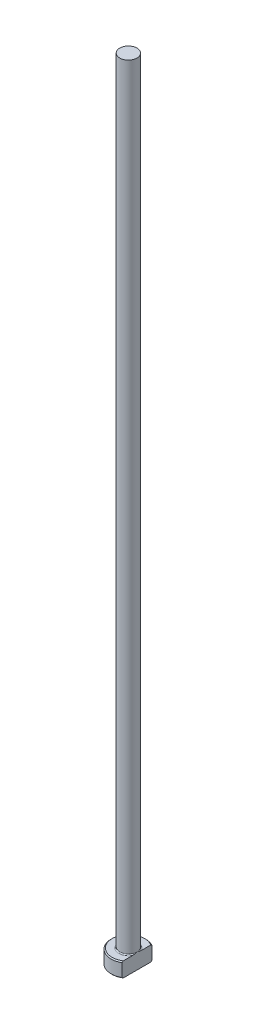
ISO-10303-21;
HEADER;
FILE_DESCRIPTION(('STEP AP214'),'2;1');
FILE_NAME('part.step','',(''),(''),'','','');
FILE_SCHEMA(('AUTOMOTIVE_DESIGN { 1 0 10303 214 1 1 1 1 }'));
ENDSEC;
DATA;
#1=APPLICATION_CONTEXT('core data for automotive mechanical design processes');
#2=APPLICATION_PROTOCOL_DEFINITION('international standard','automotive_design',2000,#1);
#3=PRODUCT_CONTEXT('',#1,'mechanical');
#4=PRODUCT('Part','Part','',(#3));
#5=PRODUCT_RELATED_PRODUCT_CATEGORY('part','',(#4));
#6=PRODUCT_DEFINITION_FORMATION('','',#4);
#7=PRODUCT_DEFINITION_CONTEXT('part definition',#1,'design');
#8=PRODUCT_DEFINITION('design','',#6,#7);
#9=PRODUCT_DEFINITION_SHAPE('','',#8);
#10=(LENGTH_UNIT() NAMED_UNIT(*) SI_UNIT(.MILLI.,.METRE.));
#11=(NAMED_UNIT(*) PLANE_ANGLE_UNIT() SI_UNIT($,.RADIAN.));
#12=(NAMED_UNIT(*) SI_UNIT($,.STERADIAN.) SOLID_ANGLE_UNIT());
#13=UNCERTAINTY_MEASURE_WITH_UNIT(LENGTH_MEASURE(1.E-05),#10,'distance_accuracy_value','');
#14=(GEOMETRIC_REPRESENTATION_CONTEXT(3) GLOBAL_UNCERTAINTY_ASSIGNED_CONTEXT((#13)) GLOBAL_UNIT_ASSIGNED_CONTEXT((#10,
#11,#12)) REPRESENTATION_CONTEXT('',''));
#15=CARTESIAN_POINT('',(0.,0.,0.));
#16=DIRECTION('',(0.,0.,1.));
#17=DIRECTION('',(1.,0.,0.));
#18=AXIS2_PLACEMENT_3D('',#15,#16,#17);
#19=CARTESIAN_POINT('',(0.,0.,0.));
#20=DIRECTION('',(0.,-1.,0.));
#21=DIRECTION('',(0.,0.,-1.));
#22=AXIS2_PLACEMENT_3D('',#19,#20,#21);
#23=PLANE('',#22);
#24=CARTESIAN_POINT('',(0.,0.,0.));
#25=DIRECTION('',(0.,-1.,0.));
#26=DIRECTION('',(0.,0.,-1.));
#27=AXIS2_PLACEMENT_3D('',#24,#25,#26);
#28=CIRCLE('',#27,3.29999999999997);
#29=CARTESIAN_POINT('',(1.74999999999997,0.,2.79776696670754));
#30=VERTEX_POINT('',#29);
#31=CARTESIAN_POINT('',(1.74999999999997,0.,-2.79776696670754));
#32=VERTEX_POINT('',#31);
#33=EDGE_CURVE('E98',#30,#32,#28,.T.);
#34=ORIENTED_EDGE('',*,*,#33,.T.);
#35=DIRECTION('',(0.,0.,1.));
#36=VECTOR('',#35,1.);
#37=CARTESIAN_POINT('',(1.74999999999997,0.,-3.03108891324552));
#38=LINE('',#37,#36);
#39=EDGE_CURVE('E83',#32,#30,#38,.T.);
#40=ORIENTED_EDGE('',*,*,#39,.T.);
#41=EDGE_LOOP('',(#34,#40));
#42=FACE_BOUND('',#41,.T.);
#43=ADVANCED_FACE('F32',(#42),#23,.T.);
#44=CARTESIAN_POINT('',(0.,259.958771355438,0.));
#45=DIRECTION('',(0.,1.,0.));
#46=DIRECTION('',(0.,0.,1.));
#47=AXIS2_PLACEMENT_3D('',#44,#45,#46);
#48=CYLINDRICAL_SURFACE('',#47,3.49999999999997);
#49=CARTESIAN_POINT('',(0.,2.79999999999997,0.));
#50=DIRECTION('',(0.,1.,0.));
#51=DIRECTION('',(0.,0.,1.));
#52=AXIS2_PLACEMENT_3D('',#49,#50,#51);
#53=CIRCLE('',#52,3.49999999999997);
#54=CARTESIAN_POINT('',(1.74999999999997,2.79999999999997,3.03108891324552));
#55=VERTEX_POINT('',#54);
#56=CARTESIAN_POINT('',(1.74999999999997,2.79999999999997,-3.03108891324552));
#57=VERTEX_POINT('',#56);
#58=EDGE_CURVE('E104',#55,#57,#53,.F.);
#59=ORIENTED_EDGE('',*,*,#58,.T.);
#60=DIRECTION('',(0.,-1.,0.));
#61=VECTOR('',#60,1.);
#62=CARTESIAN_POINT('',(1.74999999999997,160.,-3.03108891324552));
#63=LINE('',#62,#61);
#64=CARTESIAN_POINT('',(1.74999999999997,0.199999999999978,-3.03108891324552));
#65=VERTEX_POINT('',#64);
#66=EDGE_CURVE('E183',#57,#65,#63,.T.);
#67=ORIENTED_EDGE('',*,*,#66,.T.);
#68=CARTESIAN_POINT('',(0.,0.199999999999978,0.));
#69=DIRECTION('',(0.,-1.,0.));
#70=DIRECTION('',(0.,0.,-1.));
#71=AXIS2_PLACEMENT_3D('',#68,#69,#70);
#72=CIRCLE('',#71,3.49999999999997);
#73=CARTESIAN_POINT('',(1.74999999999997,0.199999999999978,3.03108891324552));
#74=VERTEX_POINT('',#73);
#75=EDGE_CURVE('E100',#65,#74,#72,.F.);
#76=ORIENTED_EDGE('',*,*,#75,.T.);
#77=DIRECTION('',(0.,-1.,0.));
#78=VECTOR('',#77,1.);
#79=CARTESIAN_POINT('',(1.74999999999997,160.,3.03108891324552));
#80=LINE('',#79,#78);
#81=EDGE_CURVE('E93',#55,#74,#80,.T.);
#82=ORIENTED_EDGE('',*,*,#81,.F.);
#83=EDGE_LOOP('',(#59,#67,#76,#82));
#84=FACE_BOUND('',#83,.T.);
#85=ADVANCED_FACE('F158',(#84),#48,.T.);
#86=CARTESIAN_POINT('',(-3.49999999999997,3.,0.));
#87=DIRECTION('',(0.,1.,0.));
#88=DIRECTION('',(0.,0.,1.));
#89=AXIS2_PLACEMENT_3D('',#86,#87,#88);
#90=PLANE('',#89);
#91=CARTESIAN_POINT('',(0.,3.,0.));
#92=DIRECTION('',(0.,1.,0.));
#93=DIRECTION('',(0.,0.,1.));
#94=AXIS2_PLACEMENT_3D('',#91,#92,#93);
#95=CIRCLE('',#94,3.29999999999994);
#96=CARTESIAN_POINT('',(1.74999999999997,3.,-2.79776696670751));
#97=VERTEX_POINT('',#96);
#98=CARTESIAN_POINT('',(1.74999999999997,3.,2.79776696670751));
#99=VERTEX_POINT('',#98);
#100=EDGE_CURVE('E178',#97,#99,#95,.T.);
#101=ORIENTED_EDGE('',*,*,#100,.T.);
#102=DIRECTION('',(0.,0.,-1.));
#103=VECTOR('',#102,1.);
#104=CARTESIAN_POINT('',(1.74999999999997,3.,0.));
#105=LINE('',#104,#103);
#106=CARTESIAN_POINT('',(1.74999999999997,2.99999999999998,0.860232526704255));
#107=VERTEX_POINT('',#106);
#108=EDGE_CURVE('E57',#99,#107,#105,.T.);
#109=ORIENTED_EDGE('',*,*,#108,.T.);
#110=CARTESIAN_POINT('',(0.,3.,0.));
#111=DIRECTION('',(0.,1.,0.));
#112=DIRECTION('',(0.,0.,1.));
#113=AXIS2_PLACEMENT_3D('',#110,#111,#112);
#114=CIRCLE('',#113,1.94999999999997);
#115=CARTESIAN_POINT('',(1.74999999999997,2.99999999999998,-0.860232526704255));
#116=VERTEX_POINT('',#115);
#117=EDGE_CURVE('E107',#107,#116,#114,.F.);
#118=ORIENTED_EDGE('',*,*,#117,.T.);
#119=EDGE_CURVE('E136',#116,#97,#105,.T.);
#120=ORIENTED_EDGE('',*,*,#119,.T.);
#121=EDGE_LOOP('',(#101,#109,#118,#120));
#122=FACE_BOUND('',#121,.T.);
#123=ADVANCED_FACE('F147',(#122),#90,.T.);
#124=CARTESIAN_POINT('',(0.,3.,0.));
#125=DIRECTION('',(0.,-1.,0.));
#126=DIRECTION('',(0.,0.,-1.));
#127=AXIS2_PLACEMENT_3D('',#124,#125,#126);
#128=CONICAL_SURFACE('',#127,3.29999999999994,0.785398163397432);
#129=ORIENTED_EDGE('',*,*,#58,.F.);
#130=CARTESIAN_POINT('',(1.74999999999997,-0.596308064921,6.67057455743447));
#131=CARTESIAN_POINT('',(1.74999999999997,-0.450097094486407,6.5194071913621));
#132=CARTESIAN_POINT('',(1.74999999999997,-0.304043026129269,6.36808756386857));
#133=CARTESIAN_POINT('',(1.74999999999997,-0.0123415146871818,6.06505321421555));
#134=CARTESIAN_POINT('',(1.74999999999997,0.133305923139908,5.91333848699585));
#135=CARTESIAN_POINT('',(1.74999999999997,0.424172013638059,5.60934946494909));
#136=CARTESIAN_POINT('',(1.74999999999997,0.569390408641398,5.45707492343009));
#137=CARTESIAN_POINT('',(1.74999999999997,0.859185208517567,5.15191761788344));
#138=CARTESIAN_POINT('',(1.74999999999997,1.00376161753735,4.99903485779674));
#139=CARTESIAN_POINT('',(1.74999999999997,1.28922437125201,4.69552747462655));
#140=CARTESIAN_POINT('',(1.74999999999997,1.43012702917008,4.54491820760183));
#141=CARTESIAN_POINT('',(1.74999999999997,1.71087777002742,4.24272028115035));
#142=CARTESIAN_POINT('',(1.74999999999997,1.85072585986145,4.09113162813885));
#143=CARTESIAN_POINT('',(1.74999999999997,2.12895853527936,3.78667524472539));
#144=CARTESIAN_POINT('',(1.74999999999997,2.26734342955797,3.63380779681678));
#145=CARTESIAN_POINT('',(1.74999999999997,2.54209958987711,3.3262768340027));
#146=CARTESIAN_POINT('',(1.74999999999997,2.6784709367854,3.1716133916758));
#147=CARTESIAN_POINT('',(1.74999999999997,2.89617282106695,2.91990258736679));
#148=CARTESIAN_POINT('',(1.74999999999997,2.97843114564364,2.82365864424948));
#149=CARTESIAN_POINT('',(1.74999999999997,3.14148360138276,2.62991861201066));
#150=CARTESIAN_POINT('',(1.74999999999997,3.22227758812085,2.53242240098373));
#151=CARTESIAN_POINT('',(1.74999999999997,3.38274452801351,2.33479038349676));
#152=CARTESIAN_POINT('',(1.74999999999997,3.46239661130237,2.23463757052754));
#153=CARTESIAN_POINT('',(1.74999999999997,3.61891495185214,2.03220225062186));
#154=CARTESIAN_POINT('',(1.74999999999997,3.69578187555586,1.92992026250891));
#155=CARTESIAN_POINT('',(1.74999999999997,3.8466965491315,1.72090511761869));
#156=CARTESIAN_POINT('',(1.74999999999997,3.92068375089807,1.61412795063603));
#157=CARTESIAN_POINT('',(1.74999999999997,4.06269616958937,1.396383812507));
#158=CARTESIAN_POINT('',(1.74999999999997,4.13071318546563,1.28541136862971));
#159=CARTESIAN_POINT('',(1.74999999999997,4.22516490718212,1.11561175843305));
#160=CARTESIAN_POINT('',(1.74999999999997,4.25522351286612,1.05881631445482));
#161=CARTESIAN_POINT('',(1.74999999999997,4.31237042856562,0.943756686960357));
#162=CARTESIAN_POINT('',(1.74999999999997,4.33945819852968,0.885492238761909));
#163=CARTESIAN_POINT('',(1.74999999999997,4.41499290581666,0.708569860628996));
#164=CARTESIAN_POINT('',(1.74999999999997,4.45796078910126,0.587356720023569));
#165=CARTESIAN_POINT('',(1.74999999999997,4.50447230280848,0.405622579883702));
#166=CARTESIAN_POINT('',(1.74999999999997,4.51680920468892,0.347327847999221));
#167=CARTESIAN_POINT('',(1.74999999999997,4.53592536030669,0.229813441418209));
#168=CARTESIAN_POINT('',(1.74999999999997,4.54270510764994,0.170593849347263));
#169=CARTESIAN_POINT('',(1.74999999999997,4.55022681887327,0.0519516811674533));
#170=CARTESIAN_POINT('',(1.74999999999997,4.55098747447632,-0.00746969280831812));
#171=CARTESIAN_POINT('',(1.74999999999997,4.54646541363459,-0.126082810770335));
#172=CARTESIAN_POINT('',(1.74999999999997,4.54118219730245,-0.185274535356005));
#173=CARTESIAN_POINT('',(1.74999999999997,4.52501178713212,-0.302357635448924));
#174=CARTESIAN_POINT('',(1.74999999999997,4.51417270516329,-0.360255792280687));
#175=CARTESIAN_POINT('',(1.74999999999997,4.48756668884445,-0.474896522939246));
#176=CARTESIAN_POINT('',(1.74999999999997,4.47179916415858,-0.531638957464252));
#177=CARTESIAN_POINT('',(1.74999999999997,4.43599695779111,-0.644103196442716));
#178=CARTESIAN_POINT('',(1.74999999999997,4.41593824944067,-0.699817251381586));
#179=CARTESIAN_POINT('',(1.74999999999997,4.37235913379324,-0.809843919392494));
#180=CARTESIAN_POINT('',(1.74999999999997,4.3488394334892,-0.864156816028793));
#181=CARTESIAN_POINT('',(1.74999999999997,4.27385837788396,-1.02562379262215));
#182=CARTESIAN_POINT('',(1.74999999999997,4.21814894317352,-1.13079943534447));
#183=CARTESIAN_POINT('',(1.74999999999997,4.0993572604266,-1.33694307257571));
#184=CARTESIAN_POINT('',(1.74999999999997,4.03626572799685,-1.43790554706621));
#185=CARTESIAN_POINT('',(1.74999999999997,3.90490246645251,-1.63694628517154));
#186=CARTESIAN_POINT('',(1.74999999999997,3.83661129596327,-1.73501160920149));
#187=CARTESIAN_POINT('',(1.74999999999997,3.69663576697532,-1.92859117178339));
#188=CARTESIAN_POINT('',(1.74999999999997,3.62495312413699,-2.02410666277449));
#189=CARTESIAN_POINT('',(1.74999999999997,3.47817312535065,-2.21448054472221));
#190=CARTESIAN_POINT('',(1.74999999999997,3.40304324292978,-2.30931373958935));
#191=CARTESIAN_POINT('',(1.74999999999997,3.25092223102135,-2.49748629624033));
#192=CARTESIAN_POINT('',(1.74999999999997,3.17393090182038,-2.59082549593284));
#193=CARTESIAN_POINT('',(1.74999999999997,3.01873588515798,-2.77610276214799));
#194=CARTESIAN_POINT('',(1.74999999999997,2.94053559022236,-2.86804367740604));
#195=CARTESIAN_POINT('',(1.74999999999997,2.78305359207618,-3.05099558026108));
#196=CARTESIAN_POINT('',(1.74999999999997,2.70377186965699,-3.14200655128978));
#197=CARTESIAN_POINT('',(1.74999999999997,2.49177755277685,-3.38307713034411));
#198=CARTESIAN_POINT('',(1.74999999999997,2.3583209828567,-3.53248201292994));
#199=CARTESIAN_POINT('',(1.74999999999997,2.08977689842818,-3.82982116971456));
#200=CARTESIAN_POINT('',(1.74999999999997,1.95468933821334,-3.9777554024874));
#201=CARTESIAN_POINT('',(1.74999999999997,1.68319766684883,-4.27266697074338));
#202=CARTESIAN_POINT('',(1.74999999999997,1.54679243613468,-4.4196432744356));
#203=CARTESIAN_POINT('',(1.74999999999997,1.27308598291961,-4.71275937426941));
#204=CARTESIAN_POINT('',(1.74999999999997,1.13578475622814,-4.85889916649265));
#205=CARTESIAN_POINT('',(1.74999999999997,0.734183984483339,-5.28435414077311));
#206=CARTESIAN_POINT('',(1.74999999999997,0.468971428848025,-5.56280727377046));
#207=CARTESIAN_POINT('',(1.74999999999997,0.0701049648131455,-5.97918348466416));
#208=CARTESIAN_POINT('',(1.74999999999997,-0.0629507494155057,-6.11768155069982));
#209=CARTESIAN_POINT('',(1.74999999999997,-0.32939522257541,-6.39435480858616));
#210=CARTESIAN_POINT('',(1.74999999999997,-0.462783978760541,-6.53253000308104));
#211=CARTESIAN_POINT('',(1.74999999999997,-0.596308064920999,-6.67057455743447));
#212=B_SPLINE_CURVE_WITH_KNOTS('',3,(#130,#131,#132,#133,#134,#135,#136,#137,#138,#139,#140,
#141,#142,#143,#144,#145,#146,#147,#148,#149,#150,#151,#152,#153,#154,#155,#156,#157,#158,#159,
#160,#161,#162,#163,#164,#165,#166,#167,#168,#169,#170,#171,#172,#173,#174,#175,#176,#177,#178,
#179,#180,#181,#182,#183,#184,#185,#186,#187,#188,#189,#190,#191,#192,#193,#194,#195,#196,#197,
#198,#199,#200,#201,#202,#203,#204,#205,#206,#207,#208,#209,#210,#211),.UNSPECIFIED.,.F.,.F.,(4,
2,2,2,2,2,2,2,2,2,2,2,2,2,2,2,2,2,2,2,2,2,2,2,2,2,2,2,2,2,2,2,2,2,2,2,2,2,2,2,4),(0.,
0.63092275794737,1.26185363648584,1.89310749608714,2.5243572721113,3.1430865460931,
3.76181177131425,4.38040374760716,4.9989708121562,5.37878108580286,5.75862861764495,
6.14249031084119,6.52625953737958,6.91585739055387,7.30598230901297,7.49867618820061,
7.69140503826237,8.07538783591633,8.25392686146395,8.43245002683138,8.610418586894,
8.7884018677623,8.96486927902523,9.14135783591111,9.31886171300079,9.49632938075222,
9.85286274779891,10.209849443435,10.5682434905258,10.9264581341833,11.2893876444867,
11.652356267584,12.0144447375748,12.3765396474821,12.9775131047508,13.5785034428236,
14.1800594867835,14.7816183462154,15.9352370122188,16.5114050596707,17.087568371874),.UNSPECIFIED.);
#213=EDGE_CURVE('E135',#55,#99,#212,.T.);
#214=ORIENTED_EDGE('',*,*,#213,.T.);
#215=ORIENTED_EDGE('',*,*,#100,.F.);
#216=EDGE_CURVE('E127',#97,#57,#212,.T.);
#217=ORIENTED_EDGE('',*,*,#216,.T.);
#218=EDGE_LOOP('',(#129,#214,#215,#217));
#219=FACE_BOUND('',#218,.T.);
#220=ADVANCED_FACE('F143',(#219),#128,.T.);
#221=CARTESIAN_POINT('',(0.,0.199999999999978,0.));
#222=DIRECTION('',(0.,1.,0.));
#223=DIRECTION('',(0.,0.,1.));
#224=AXIS2_PLACEMENT_3D('',#221,#222,#223);
#225=CONICAL_SURFACE('',#224,3.49999999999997,0.785398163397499);
#226=ORIENTED_EDGE('',*,*,#75,.F.);
#227=CARTESIAN_POINT('',(1.74999999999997,3.59630806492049,-6.67057455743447));
#228=CARTESIAN_POINT('',(1.74999999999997,3.45009709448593,-6.51940719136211));
#229=CARTESIAN_POINT('',(1.74999999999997,3.30404302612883,-6.36808756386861));
#230=CARTESIAN_POINT('',(1.74999999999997,3.01234151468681,-6.0650532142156));
#231=CARTESIAN_POINT('',(1.74999999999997,2.86669407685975,-5.91333848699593));
#232=CARTESIAN_POINT('',(1.74999999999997,2.57582798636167,-5.60934946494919));
#233=CARTESIAN_POINT('',(1.74999999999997,2.43060959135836,-5.45707492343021));
#234=CARTESIAN_POINT('',(1.74999999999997,2.14081479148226,-5.15191761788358));
#235=CARTESIAN_POINT('',(1.74999999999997,1.99623838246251,-4.9990348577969));
#236=CARTESIAN_POINT('',(1.74999999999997,1.71077562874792,-4.69552747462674));
#237=CARTESIAN_POINT('',(1.74999999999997,1.56987297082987,-4.54491820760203));
#238=CARTESIAN_POINT('',(1.74999999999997,1.28912222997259,-4.24272028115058));
#239=CARTESIAN_POINT('',(1.74999999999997,1.1492741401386,-4.0911316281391));
#240=CARTESIAN_POINT('',(1.74999999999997,0.871041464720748,-3.78667524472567));
#241=CARTESIAN_POINT('',(1.74999999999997,0.732656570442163,-3.63380779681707));
#242=CARTESIAN_POINT('',(1.74999999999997,0.457900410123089,-3.32627683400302));
#243=CARTESIAN_POINT('',(1.74999999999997,0.321529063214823,-3.17161339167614));
#244=CARTESIAN_POINT('',(1.74999999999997,0.103827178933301,-2.91990258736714));
#245=CARTESIAN_POINT('',(1.74999999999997,0.0215688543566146,-2.82365864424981));
#246=CARTESIAN_POINT('',(1.74999999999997,-0.141483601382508,-2.62991861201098));
#247=CARTESIAN_POINT('',(1.74999999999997,-0.222277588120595,-2.53242240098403));
#248=CARTESIAN_POINT('',(1.74999999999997,-0.382744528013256,-2.33479038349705));
#249=CARTESIAN_POINT('',(1.74999999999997,-0.462396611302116,-2.23463757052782));
#250=CARTESIAN_POINT('',(1.74999999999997,-0.618914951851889,-2.03220225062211));
#251=CARTESIAN_POINT('',(1.74999999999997,-0.695781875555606,-1.92992026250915));
#252=CARTESIAN_POINT('',(1.74999999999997,-0.84669654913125,-1.72090511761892));
#253=CARTESIAN_POINT('',(1.74999999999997,-0.920683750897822,-1.61412795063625));
#254=CARTESIAN_POINT('',(1.74999999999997,-1.06269616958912,-1.39638381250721));
#255=CARTESIAN_POINT('',(1.74999999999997,-1.13071318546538,-1.28541136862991));
#256=CARTESIAN_POINT('',(1.74999999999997,-1.22516490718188,-1.11561175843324));
#257=CARTESIAN_POINT('',(1.74999999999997,-1.25522351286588,-1.058816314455));
#258=CARTESIAN_POINT('',(1.74999999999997,-1.31237042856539,-0.943756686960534));
#259=CARTESIAN_POINT('',(1.74999999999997,-1.33945819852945,-0.885492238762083));
#260=CARTESIAN_POINT('',(1.74999999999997,-1.41499290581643,-0.708569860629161));
#261=CARTESIAN_POINT('',(1.74999999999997,-1.45796078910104,-0.58735672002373));
#262=CARTESIAN_POINT('',(1.74999999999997,-1.50447230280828,-0.405622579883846));
#263=CARTESIAN_POINT('',(1.74999999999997,-1.51680920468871,-0.347327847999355));
#264=CARTESIAN_POINT('',(1.74999999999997,-1.53592536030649,-0.229813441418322));
#265=CARTESIAN_POINT('',(1.74999999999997,-1.54270510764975,-0.170593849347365));
#266=CARTESIAN_POINT('',(1.74999999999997,-1.55022681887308,-0.0519516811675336));
#267=CARTESIAN_POINT('',(1.74999999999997,-1.55098747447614,0.00746969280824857));
#268=CARTESIAN_POINT('',(1.74999999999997,-1.54646541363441,0.126082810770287));
#269=CARTESIAN_POINT('',(1.74999999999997,-1.54118219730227,0.185274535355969));
#270=CARTESIAN_POINT('',(1.74999999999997,-1.52501178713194,0.30235763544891));
#271=CARTESIAN_POINT('',(1.74999999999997,-1.51417270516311,0.360255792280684));
#272=CARTESIAN_POINT('',(1.74999999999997,-1.48756668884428,0.474896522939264));
#273=CARTESIAN_POINT('',(1.74999999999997,-1.4717991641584,0.531638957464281));
#274=CARTESIAN_POINT('',(1.74999999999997,-1.43599695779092,0.644103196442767));
#275=CARTESIAN_POINT('',(1.74999999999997,-1.41593824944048,0.699817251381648));
#276=CARTESIAN_POINT('',(1.74999999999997,-1.37235913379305,0.809843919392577));
#277=CARTESIAN_POINT('',(1.74999999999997,-1.348839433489,0.864156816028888));
#278=CARTESIAN_POINT('',(1.74999999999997,-1.27385837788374,1.0256237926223));
#279=CARTESIAN_POINT('',(1.74999999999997,-1.21814894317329,1.13079943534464));
#280=CARTESIAN_POINT('',(1.74999999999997,-1.09935726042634,1.33694307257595));
#281=CARTESIAN_POINT('',(1.74999999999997,-1.03626572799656,1.43790554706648));
#282=CARTESIAN_POINT('',(1.74999999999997,-0.904902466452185,1.63694628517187));
#283=CARTESIAN_POINT('',(1.74999999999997,-0.836611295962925,1.73501160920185));
#284=CARTESIAN_POINT('',(1.74999999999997,-0.696635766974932,1.92859117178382));
#285=CARTESIAN_POINT('',(1.74999999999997,-0.624953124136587,2.02410666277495));
#286=CARTESIAN_POINT('',(1.74999999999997,-0.478173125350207,2.21448054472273));
#287=CARTESIAN_POINT('',(1.74999999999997,-0.403043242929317,2.3093137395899));
#288=CARTESIAN_POINT('',(1.74999999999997,-0.250922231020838,2.49748629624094));
#289=CARTESIAN_POINT('',(1.74999999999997,-0.173930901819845,2.59082549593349));
#290=CARTESIAN_POINT('',(1.74999999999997,-0.0187358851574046,2.7761027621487));
#291=CARTESIAN_POINT('',(1.74999999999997,0.0594644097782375,2.86804367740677));
#292=CARTESIAN_POINT('',(1.74999999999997,0.216946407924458,3.05099558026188));
#293=CARTESIAN_POINT('',(1.74999999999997,0.296228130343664,3.14200655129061));
#294=CARTESIAN_POINT('',(1.74999999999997,0.508222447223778,3.38307713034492));
#295=CARTESIAN_POINT('',(1.74999999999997,0.641679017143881,3.53248201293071));
#296=CARTESIAN_POINT('',(1.74999999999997,0.910223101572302,3.82982116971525));
#297=CARTESIAN_POINT('',(1.74999999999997,1.04531066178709,3.97775540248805));
#298=CARTESIAN_POINT('',(1.74999999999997,1.3168023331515,4.27266697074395));
#299=CARTESIAN_POINT('',(1.74999999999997,1.45320756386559,4.41964327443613));
#300=CARTESIAN_POINT('',(1.74999999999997,1.72691401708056,4.71275937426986));
#301=CARTESIAN_POINT('',(1.74999999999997,1.86421524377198,4.85889916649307));
#302=CARTESIAN_POINT('',(1.74999999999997,2.26581601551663,5.28435414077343));
#303=CARTESIAN_POINT('',(1.74999999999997,2.53102857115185,5.56280727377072));
#304=CARTESIAN_POINT('',(1.74999999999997,2.92989503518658,5.97918348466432));
#305=CARTESIAN_POINT('',(1.74999999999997,3.06295074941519,6.11768155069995));
#306=CARTESIAN_POINT('',(1.74999999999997,3.329395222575,6.39435480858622));
#307=CARTESIAN_POINT('',(1.74999999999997,3.46278397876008,6.53253000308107));
#308=CARTESIAN_POINT('',(1.74999999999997,3.59630806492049,6.67057455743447));
#309=B_SPLINE_CURVE_WITH_KNOTS('',3,(#227,#228,#229,#230,#231,#232,#233,#234,#235,#236,#237,
#238,#239,#240,#241,#242,#243,#244,#245,#246,#247,#248,#249,#250,#251,#252,#253,#254,#255,#256,
#257,#258,#259,#260,#261,#262,#263,#264,#265,#266,#267,#268,#269,#270,#271,#272,#273,#274,#275,
#276,#277,#278,#279,#280,#281,#282,#283,#284,#285,#286,#287,#288,#289,#290,#291,#292,#293,#294,
#295,#296,#297,#298,#299,#300,#301,#302,#303,#304,#305,#306,#307,#308),.UNSPECIFIED.,.F.,.F.,(4,
2,2,2,2,2,2,2,2,2,2,2,2,2,2,2,2,2,2,2,2,2,2,2,2,2,2,2,2,2,2,2,2,2,2,2,2,2,2,2,4),(0.,
0.630922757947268,1.26185363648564,1.89310749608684,2.52435727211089,3.1430865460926,
3.76181177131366,4.38040374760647,4.99897081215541,5.37878108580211,5.75862861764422,
6.14249031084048,6.52625953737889,6.9158573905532,7.30598230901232,7.49867618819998,
7.69140503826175,8.07538783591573,8.25392686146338,8.43245002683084,8.6104185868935,
8.78840186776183,8.9648692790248,9.14135783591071,9.31886171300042,9.49632938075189,
9.85286274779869,10.2098494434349,10.5682434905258,10.9264581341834,11.2893876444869,
11.6523562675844,12.0144447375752,12.3765396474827,12.9775131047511,13.5785034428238,
14.1800594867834,14.7816183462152,15.9352370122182,16.51140505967,17.0875683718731),.UNSPECIFIED.);
#310=EDGE_CURVE('E86',#65,#32,#309,.T.);
#311=ORIENTED_EDGE('',*,*,#310,.T.);
#312=ORIENTED_EDGE('',*,*,#33,.F.);
#313=EDGE_CURVE('E89',#30,#74,#309,.T.);
#314=ORIENTED_EDGE('',*,*,#313,.T.);
#315=EDGE_LOOP('',(#226,#311,#312,#314));
#316=FACE_BOUND('',#315,.T.);
#317=ADVANCED_FACE('F97',(#316),#225,.T.);
#318=CARTESIAN_POINT('',(0.,3.19999999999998,0.));
#319=DIRECTION('',(0.,1.,0.));
#320=DIRECTION('',(0.,0.,1.));
#321=AXIS2_PLACEMENT_3D('',#318,#319,#320);
#322=TOROIDAL_SURFACE('',#321,1.94999999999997,0.2);
#323=CARTESIAN_POINT('',(1.74999999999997,3.19999999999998,0.));
#324=CARTESIAN_POINT('',(1.74999999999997,3.20000050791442,9.38679694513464E-11));
#325=CARTESIAN_POINT('',(1.74999999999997,3.20000101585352,-1.34501098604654E-07));
#326=CARTESIAN_POINT('',(1.74999999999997,3.20000198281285,-5.41283468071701E-07));
#327=CARTESIAN_POINT('',(1.74999999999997,3.20000243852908,-8.19487700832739E-07));
#328=CARTESIAN_POINT('',(1.74999999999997,3.20000335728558,-1.4843911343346E-06));
#329=CARTESIAN_POINT('',(1.74999999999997,3.20000381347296,-1.88052630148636E-06));
#330=CARTESIAN_POINT('',(1.74999999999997,3.20000466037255,-2.72280863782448E-06));
#331=CARTESIAN_POINT('',(1.74999999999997,3.20000505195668,-3.16812551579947E-06));
#332=CARTESIAN_POINT('',(1.74999999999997,3.20000641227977,-4.80772278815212E-06));
#333=CARTESIAN_POINT('',(1.74999999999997,3.20000730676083,-6.06508167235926E-06));
#334=CARTESIAN_POINT('',(1.74999999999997,3.20000885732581,-8.62364306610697E-06));
#335=CARTESIAN_POINT('',(1.74999999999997,3.20000952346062,-9.91907764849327E-06));
#336=CARTESIAN_POINT('',(1.74999999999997,3.20001212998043,-1.51310765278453E-05));
#337=CARTESIAN_POINT('',(1.74999999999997,3.20001395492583,-1.91092654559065E-05));
#338=CARTESIAN_POINT('',(1.74999999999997,3.2000168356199,-2.68327805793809E-05));
#339=CARTESIAN_POINT('',(1.74999999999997,3.20001795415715,-3.05551299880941E-05));
#340=CARTESIAN_POINT('',(1.74999999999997,3.20002287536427,-4.68261372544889E-05));
#341=CARTESIAN_POINT('',(1.74999999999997,3.20002674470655,-5.93446276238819E-05));
#342=CARTESIAN_POINT('',(1.74999999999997,3.20003278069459,-8.25255939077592E-05));
#343=CARTESIAN_POINT('',(1.74999999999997,3.20003512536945,-9.31393220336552E-05));
#344=CARTESIAN_POINT('',(1.74999999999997,3.20005413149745,-0.00017197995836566));
#345=CARTESIAN_POINT('',(1.74999999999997,3.20007897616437,-0.000237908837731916));
#346=CARTESIAN_POINT('',(1.74999999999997,3.20017305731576,-0.000496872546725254));
#347=CARTESIAN_POINT('',(1.74999999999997,3.20023617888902,-0.00069150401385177));
#348=CARTESIAN_POINT('',(1.74999999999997,3.20048774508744,-0.00145613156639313));
#349=CARTESIAN_POINT('',(1.74999999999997,3.20068259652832,-0.00202450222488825));
#350=CARTESIAN_POINT('',(1.74999999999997,3.20148279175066,-0.0043694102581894));
#351=CARTESIAN_POINT('',(1.74999999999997,3.20208089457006,-0.00614773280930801));
#352=CARTESIAN_POINT('',(1.74999999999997,3.20853845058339,-0.0253339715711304));
#353=CARTESIAN_POINT('',(1.74999999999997,3.21443574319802,-0.0427328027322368));
#354=CARTESIAN_POINT('',(1.74999999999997,3.22594434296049,-0.0768841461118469));
#355=CARTESIAN_POINT('',(1.74999999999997,3.2315579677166,-0.0936359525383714));
#356=CARTESIAN_POINT('',(1.74999999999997,3.24339960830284,-0.129193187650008));
#357=CARTESIAN_POINT('',(1.74999999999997,3.24961959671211,-0.148001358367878));
#358=CARTESIAN_POINT('',(1.74999999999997,3.26199268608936,-0.185858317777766));
#359=CARTESIAN_POINT('',(1.74999999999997,3.26814439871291,-0.204907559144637));
#360=CARTESIAN_POINT('',(1.74999999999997,3.28302129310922,-0.251728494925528));
#361=CARTESIAN_POINT('',(1.74999999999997,3.29164632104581,-0.279532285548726));
#362=CARTESIAN_POINT('',(1.74999999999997,3.30815507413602,-0.334622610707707));
#363=CARTESIAN_POINT('',(1.74999999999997,3.31605173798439,-0.361905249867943));
#364=CARTESIAN_POINT('',(1.74999999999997,3.33270110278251,-0.422187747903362));
#365=CARTESIAN_POINT('',(1.74999999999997,3.34130455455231,-0.4552293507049));
#366=CARTESIAN_POINT('',(1.74999999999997,3.35728256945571,-0.521873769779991));
#367=CARTESIAN_POINT('',(1.74999999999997,3.36464748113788,-0.555478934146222));
#368=CARTESIAN_POINT('',(1.74999999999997,3.37810121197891,-0.62522543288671));
#369=CARTESIAN_POINT('',(1.74999999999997,3.38407559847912,-0.661389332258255));
#370=CARTESIAN_POINT('',(1.74999999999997,3.39348021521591,-0.733973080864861));
#371=CARTESIAN_POINT('',(1.74999999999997,3.39691695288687,-0.770392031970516));
#372=CARTESIAN_POINT('',(1.74999999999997,3.39990626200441,-0.832262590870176));
#373=CARTESIAN_POINT('',(1.74999999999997,3.40032395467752,-0.85767040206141));
#374=CARTESIAN_POINT('',(1.74999999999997,3.39916217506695,-0.908260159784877));
#375=CARTESIAN_POINT('',(1.74999999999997,3.39759783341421,-0.933442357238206));
#376=CARTESIAN_POINT('',(1.74999999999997,3.39129859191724,-0.989903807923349));
#377=CARTESIAN_POINT('',(1.74999999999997,3.38586007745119,-1.02110925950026));
#378=CARTESIAN_POINT('',(1.74999999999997,3.36964168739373,-1.08216800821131));
#379=CARTESIAN_POINT('',(1.74999999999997,3.35888918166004,-1.11202738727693));
#380=CARTESIAN_POINT('',(1.74999999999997,3.33961802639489,-1.14878048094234));
#381=CARTESIAN_POINT('',(1.74999999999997,3.33455492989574,-1.15748014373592));
#382=CARTESIAN_POINT('',(1.74999999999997,3.32351587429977,-1.1742966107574));
#383=CARTESIAN_POINT('',(1.74999999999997,3.31753946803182,-1.18241312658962));
#384=CARTESIAN_POINT('',(1.74999999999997,3.30451428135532,-1.19787793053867));
#385=CARTESIAN_POINT('',(1.74999999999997,3.29745609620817,-1.20521842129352));
#386=CARTESIAN_POINT('',(1.74999999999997,3.2822352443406,-1.21865698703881));
#387=CARTESIAN_POINT('',(1.74999999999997,3.27407476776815,-1.22475746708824));
#388=CARTESIAN_POINT('',(1.74999999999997,3.25920166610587,-1.23370537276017));
#389=CARTESIAN_POINT('',(1.74999999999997,3.25274944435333,-1.23698363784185));
#390=CARTESIAN_POINT('',(1.74999999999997,3.23939659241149,-1.24245066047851));
#391=CARTESIAN_POINT('',(1.74999999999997,3.23249637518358,-1.2446404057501));
#392=CARTESIAN_POINT('',(1.74999999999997,3.21836445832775,-1.24776583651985));
#393=CARTESIAN_POINT('',(1.74999999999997,3.21113087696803,-1.24869317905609));
#394=CARTESIAN_POINT('',(1.74999999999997,3.19661788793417,-1.24917680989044));
#395=CARTESIAN_POINT('',(1.74999999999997,3.18933848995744,-1.2487333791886));
#396=CARTESIAN_POINT('',(1.74999999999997,3.17564813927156,-1.2466228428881));
#397=CARTESIAN_POINT('',(1.74999999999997,3.16921873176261,-1.24507159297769));
#398=CARTESIAN_POINT('',(1.74999999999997,3.1566813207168,-1.24099086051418));
#399=CARTESIAN_POINT('',(1.74999999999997,3.15057343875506,-1.23846101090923));
#400=CARTESIAN_POINT('',(1.74999999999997,3.13656990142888,-1.23147130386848));
#401=CARTESIAN_POINT('',(1.74999999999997,3.1288582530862,-1.2266435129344));
#402=CARTESIAN_POINT('',(1.74999999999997,3.11430996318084,-1.21581214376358));
#403=CARTESIAN_POINT('',(1.74999999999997,3.10747539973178,-1.20980585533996));
#404=CARTESIAN_POINT('',(1.74999999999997,3.09141283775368,-1.19367262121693));
#405=CARTESIAN_POINT('',(1.74999999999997,3.0827335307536,-1.18300273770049));
#406=CARTESIAN_POINT('',(1.74999999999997,3.06710756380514,-1.16049397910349));
#407=CARTESIAN_POINT('',(1.74999999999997,3.06016260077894,-1.14865397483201));
#408=CARTESIAN_POINT('',(1.74999999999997,3.04314403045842,-1.11526045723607));
#409=CARTESIAN_POINT('',(1.74999999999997,3.03452872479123,-1.09297031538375));
#410=CARTESIAN_POINT('',(1.74999999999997,3.0205187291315,-1.04724849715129));
#411=CARTESIAN_POINT('',(1.74999999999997,3.01515578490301,-1.02380790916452));
#412=CARTESIAN_POINT('',(1.74999999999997,3.00698483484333,-0.976403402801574));
#413=CARTESIAN_POINT('',(1.74999999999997,3.00418732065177,-0.952437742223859));
#414=CARTESIAN_POINT('',(1.74999999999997,3.00064912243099,-0.9043219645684));
#415=CARTESIAN_POINT('',(1.74999999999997,2.99991269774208,-0.880171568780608));
#416=CARTESIAN_POINT('',(1.74999999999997,3.00019275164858,-0.809643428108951));
#417=CARTESIAN_POINT('',(1.74999999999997,3.00344813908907,-0.763278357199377));
#418=CARTESIAN_POINT('',(1.74999999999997,3.01492484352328,-0.664825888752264));
#419=CARTESIAN_POINT('',(1.74999999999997,3.02376250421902,-0.612819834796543));
#420=CARTESIAN_POINT('',(1.74999999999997,3.04538488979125,-0.508370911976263));
#421=CARTESIAN_POINT('',(1.74999999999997,3.0582587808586,-0.455947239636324));
#422=CARTESIAN_POINT('',(1.74999999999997,3.08196429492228,-0.368604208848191));
#423=CARTESIAN_POINT('',(1.74999999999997,3.09211504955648,-0.333493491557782));
#424=CARTESIAN_POINT('',(1.74999999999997,3.11312724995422,-0.263893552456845));
#425=CARTESIAN_POINT('',(1.74999999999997,3.12397997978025,-0.229401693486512));
#426=CARTESIAN_POINT('',(1.74999999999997,3.1449667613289,-0.164340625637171));
#427=CARTESIAN_POINT('',(1.74999999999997,3.15504975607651,-0.133754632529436));
#428=CARTESIAN_POINT('',(1.74999999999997,3.17587821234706,-0.071424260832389));
#429=CARTESIAN_POINT('',(1.74999999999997,3.18663395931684,-0.0396831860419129));
#430=CARTESIAN_POINT('',(1.74999999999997,3.19791979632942,-0.0061453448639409));
#431=CARTESIAN_POINT('',(1.74999999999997,3.1985187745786,-0.00436467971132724));
#432=CARTESIAN_POINT('',(1.74999999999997,3.19931918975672,-0.00201922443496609));
#433=CARTESIAN_POINT('',(1.74999999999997,3.1995134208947,-0.00145265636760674));
#434=CARTESIAN_POINT('',(1.74999999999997,3.19976423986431,-0.000690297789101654));
#435=CARTESIAN_POINT('',(1.74999999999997,3.19982721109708,-0.000496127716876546));
#436=CARTESIAN_POINT('',(1.74999999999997,3.19992109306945,-0.000237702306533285));
#437=CARTESIAN_POINT('',(1.74999999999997,3.19994590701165,-0.000171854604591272));
#438=CARTESIAN_POINT('',(1.74999999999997,3.19996489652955,-9.31045536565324E-05));
#439=CARTESIAN_POINT('',(1.74999999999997,3.19996724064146,-8.24963335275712E-05));
#440=CARTESIAN_POINT('',(1.74999999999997,3.19997327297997,-5.93277760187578E-05));
#441=CARTESIAN_POINT('',(1.74999999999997,3.1999771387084,-4.68160427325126E-05));
#442=CARTESIAN_POINT('',(1.74999999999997,3.19998205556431,-3.05525841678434E-05));
#443=CARTESIAN_POINT('',(1.74999999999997,3.19998317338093,-2.68310310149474E-05));
#444=CARTESIAN_POINT('',(1.74999999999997,3.19998605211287,-1.91090650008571E-05));
#445=CARTESIAN_POINT('',(1.74999999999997,3.19998787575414,-1.51315953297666E-05));
#446=CARTESIAN_POINT('',(1.74999999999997,3.19999048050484,-9.92029969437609E-06));
#447=CARTESIAN_POINT('',(1.74999999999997,3.19999114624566,-8.62492588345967E-06));
#448=CARTESIAN_POINT('',(1.74999999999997,3.19999269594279,-6.06641152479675E-06));
#449=CARTESIAN_POINT('',(1.74999999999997,3.19999358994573,-4.80903333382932E-06));
#450=CARTESIAN_POINT('',(1.74999999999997,3.19999494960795,-3.16932189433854E-06));
#451=CARTESIAN_POINT('',(1.74999999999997,3.19999534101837,-2.72395382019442E-06));
#452=CARTESIAN_POINT('',(1.74999999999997,3.19999618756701,-1.88153780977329E-06));
#453=CARTESIAN_POINT('',(1.74999999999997,3.19999664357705,-1.48531958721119E-06));
#454=CARTESIAN_POINT('',(1.74999999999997,3.1999975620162,-8.20216861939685E-07));
#455=CARTESIAN_POINT('',(1.74999999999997,3.19999801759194,-5.41901808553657E-07));
#456=CARTESIAN_POINT('',(1.74999999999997,3.19999898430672,-1.34847126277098E-07));
#457=CARTESIAN_POINT('',(1.74999999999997,3.19999949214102,-9.38577158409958E-11));
#458=CARTESIAN_POINT('',(1.74999999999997,3.19999999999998,0.));
#459=B_SPLINE_CURVE_WITH_KNOTS('',3,(#323,#324,#325,#326,#327,#328,#329,#330,#331,#332,#333,
#334,#335,#336,#337,#338,#339,#340,#341,#342,#343,#344,#345,#346,#347,#348,#349,#350,#351,#352,
#353,#354,#355,#356,#357,#358,#359,#360,#361,#362,#363,#364,#365,#366,#367,#368,#369,#370,#371,
#372,#373,#374,#375,#376,#377,#378,#379,#380,#381,#382,#383,#384,#385,#386,#387,#388,#389,#390,
#391,#392,#393,#394,#395,#396,#397,#398,#399,#400,#401,#402,#403,#404,#405,#406,#407,#408,#409,
#410,#411,#412,#413,#414,#415,#416,#417,#418,#419,#420,#421,#422,#423,#424,#425,#426,#427,#428,
#429,#430,#431,#432,#433,#434,#435,#436,#437,#438,#439,#440,#441,#442,#443,#444,#445,#446,#447,
#448,#449,#450,#451,#452,#453,#454,#455,#456,#457,#458),.UNSPECIFIED.,.T.,.F.,(4,2,2,2,2,2,2,2,
2,2,2,2,2,2,2,2,2,2,2,2,2,2,2,2,2,2,2,2,2,2,2,2,2,2,2,2,2,2,2,2,2,2,2,2,2,2,2,2,2,2,2,2,2,2,2,2,
2,2,2,2,2,2,2,2,2,2,2,4),(0.,1.52538207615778E-06,3.12059533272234E-06,4.92466458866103E-06,
6.70193593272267E-06,1.13103009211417E-05,1.56767125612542E-05,2.8774065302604E-05,
4.0421459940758E-05,7.97265134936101E-05,0.00011230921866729,0.000323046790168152,
0.000937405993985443,0.0027392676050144,0.00836862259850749,0.0634773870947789,
0.116480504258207,0.175909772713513,0.235963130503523,0.32329152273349,0.408492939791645,
0.510903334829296,0.614078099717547,0.723976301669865,0.833591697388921,0.909765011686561,
0.985360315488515,1.08013194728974,1.1744204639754,1.20457287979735,1.23474010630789,
1.26518627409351,1.29557281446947,1.3172031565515,1.33881383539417,1.36056665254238,
1.38231501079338,1.40207044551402,1.42183329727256,1.44897527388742,1.47618041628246,
1.51721056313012,1.55828069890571,1.62957223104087,1.70154887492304,1.77381858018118,
1.84623752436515,1.98535010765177,2.1434225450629,2.30526751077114,2.41490365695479,
2.52337268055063,2.61998889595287,2.72052170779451,2.72615854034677,2.72795468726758,
2.72856758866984,2.72877806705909,2.72881063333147,2.72884991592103,2.7288615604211,
2.72887465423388,2.72887901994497,2.72888362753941,2.72888540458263,2.72888720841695,
2.72888880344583,2.72889032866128),.UNSPECIFIED.);
#460=CARTESIAN_POINT('',(1.74999999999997,3.19999999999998,0.));
#461=VERTEX_POINT('',#460);
#462=EDGE_CURVE('E11',#116,#461,#459,.T.);
#463=ORIENTED_EDGE('',*,*,#462,.F.);
#464=ORIENTED_EDGE('',*,*,#117,.F.);
#465=CARTESIAN_POINT('',(1.74999999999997,3.19999999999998,0.));
#466=CARTESIAN_POINT('',(1.74999999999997,3.19999949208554,-9.38679203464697E-11));
#467=CARTESIAN_POINT('',(1.74999999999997,3.19999898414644,1.34501098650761E-07));
#468=CARTESIAN_POINT('',(1.74999999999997,3.19999801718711,5.41283468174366E-07));
#469=CARTESIAN_POINT('',(1.74999999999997,3.19999756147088,8.1948770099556E-07));
#470=CARTESIAN_POINT('',(1.74999999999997,3.19999664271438,1.48439113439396E-06));
#471=CARTESIAN_POINT('',(1.74999999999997,3.19999618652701,1.88052630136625E-06));
#472=CARTESIAN_POINT('',(1.74999999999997,3.19999533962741,2.72280863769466E-06));
#473=CARTESIAN_POINT('',(1.74999999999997,3.19999494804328,3.16812551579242E-06));
#474=CARTESIAN_POINT('',(1.74999999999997,3.1999935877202,4.80772278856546E-06));
#475=CARTESIAN_POINT('',(1.74999999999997,3.19999269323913,6.06508167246E-06));
#476=CARTESIAN_POINT('',(1.74999999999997,3.19999114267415,8.62364306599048E-06));
#477=CARTESIAN_POINT('',(1.74999999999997,3.19999047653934,9.91907764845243E-06));
#478=CARTESIAN_POINT('',(1.74999999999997,3.19998787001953,1.51310765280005E-05));
#479=CARTESIAN_POINT('',(1.74999999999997,3.19998604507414,1.91092654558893E-05));
#480=CARTESIAN_POINT('',(1.74999999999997,3.19998316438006,2.68327805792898E-05));
#481=CARTESIAN_POINT('',(1.74999999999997,3.19998204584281,3.05551299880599E-05));
#482=CARTESIAN_POINT('',(1.74999999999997,3.19997712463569,4.68261372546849E-05));
#483=CARTESIAN_POINT('',(1.74999999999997,3.19997325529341,5.93446276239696E-05));
#484=CARTESIAN_POINT('',(1.74999999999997,3.19996721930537,8.25255939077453E-05));
#485=CARTESIAN_POINT('',(1.74999999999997,3.19996487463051,9.3139322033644E-05));
#486=CARTESIAN_POINT('',(1.74999999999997,3.19994586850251,0.000171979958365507));
#487=CARTESIAN_POINT('',(1.74999999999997,3.19992102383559,0.000237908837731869));
#488=CARTESIAN_POINT('',(1.74999999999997,3.1998269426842,0.000496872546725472));
#489=CARTESIAN_POINT('',(1.74999999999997,3.19976382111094,0.000691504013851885));
#490=CARTESIAN_POINT('',(1.74999999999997,3.19951225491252,0.00145613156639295));
#491=CARTESIAN_POINT('',(1.74999999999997,3.19931740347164,0.00202450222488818));
#492=CARTESIAN_POINT('',(1.74999999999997,3.1985172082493,0.00436941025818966));
#493=CARTESIAN_POINT('',(1.74999999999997,3.1979191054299,0.00614773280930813));
#494=CARTESIAN_POINT('',(1.74999999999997,3.19146154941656,0.0253339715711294));
#495=CARTESIAN_POINT('',(1.74999999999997,3.18556425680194,0.0427328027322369));
#496=CARTESIAN_POINT('',(1.74999999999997,3.17405565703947,0.0768841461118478));
#497=CARTESIAN_POINT('',(1.74999999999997,3.16844203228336,0.0936359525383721));
#498=CARTESIAN_POINT('',(1.74999999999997,3.15660039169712,0.129193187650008));
#499=CARTESIAN_POINT('',(1.74999999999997,3.15038040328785,0.148001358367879));
#500=CARTESIAN_POINT('',(1.74999999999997,3.1380073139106,0.185858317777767));
#501=CARTESIAN_POINT('',(1.74999999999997,3.13185560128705,0.204907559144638));
#502=CARTESIAN_POINT('',(1.74999999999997,3.11697870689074,0.251728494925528));
#503=CARTESIAN_POINT('',(1.74999999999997,3.10835367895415,0.279532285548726));
#504=CARTESIAN_POINT('',(1.74999999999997,3.09184492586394,0.334622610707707));
#505=CARTESIAN_POINT('',(1.74999999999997,3.08394826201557,0.361905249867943));
#506=CARTESIAN_POINT('',(1.74999999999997,3.06729889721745,0.422187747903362));
#507=CARTESIAN_POINT('',(1.74999999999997,3.05869544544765,0.4552293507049));
#508=CARTESIAN_POINT('',(1.74999999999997,3.04271743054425,0.521873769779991));
#509=CARTESIAN_POINT('',(1.74999999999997,3.03535251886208,0.555478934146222));
#510=CARTESIAN_POINT('',(1.74999999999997,3.02189878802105,0.62522543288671));
#511=CARTESIAN_POINT('',(1.74999999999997,3.01592440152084,0.661389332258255));
#512=CARTESIAN_POINT('',(1.74999999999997,3.00651978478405,0.733973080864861));
#513=CARTESIAN_POINT('',(1.74999999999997,3.00308304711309,0.770392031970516));
#514=CARTESIAN_POINT('',(1.74999999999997,3.00009373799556,0.832262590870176));
#515=CARTESIAN_POINT('',(1.74999999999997,2.99967604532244,0.85767040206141));
#516=CARTESIAN_POINT('',(1.74999999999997,3.00083782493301,0.908260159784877));
#517=CARTESIAN_POINT('',(1.74999999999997,3.00240216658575,0.933442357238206));
#518=CARTESIAN_POINT('',(1.74999999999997,3.00870140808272,0.989903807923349));
#519=CARTESIAN_POINT('',(1.74999999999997,3.01413992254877,1.02110925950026));
#520=CARTESIAN_POINT('',(1.74999999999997,3.03035831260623,1.08216800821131));
#521=CARTESIAN_POINT('',(1.74999999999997,3.04111081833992,1.11202738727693));
#522=CARTESIAN_POINT('',(1.74999999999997,3.06038197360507,1.14878048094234));
#523=CARTESIAN_POINT('',(1.74999999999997,3.06544507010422,1.15748014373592));
#524=CARTESIAN_POINT('',(1.74999999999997,3.07648412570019,1.1742966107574));
#525=CARTESIAN_POINT('',(1.74999999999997,3.08246053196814,1.18241312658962));
#526=CARTESIAN_POINT('',(1.74999999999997,3.09548571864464,1.19787793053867));
#527=CARTESIAN_POINT('',(1.74999999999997,3.10254390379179,1.20521842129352));
#528=CARTESIAN_POINT('',(1.74999999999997,3.11776475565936,1.21865698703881));
#529=CARTESIAN_POINT('',(1.74999999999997,3.12592523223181,1.22475746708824));
#530=CARTESIAN_POINT('',(1.74999999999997,3.14079833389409,1.23370537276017));
#531=CARTESIAN_POINT('',(1.74999999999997,3.14725055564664,1.23698363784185));
#532=CARTESIAN_POINT('',(1.74999999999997,3.16060340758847,1.24245066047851));
#533=CARTESIAN_POINT('',(1.74999999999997,3.16750362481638,1.2446404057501));
#534=CARTESIAN_POINT('',(1.74999999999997,3.18163554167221,1.24776583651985));
#535=CARTESIAN_POINT('',(1.74999999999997,3.18886912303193,1.24869317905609));
#536=CARTESIAN_POINT('',(1.74999999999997,3.20338211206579,1.24917680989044));
#537=CARTESIAN_POINT('',(1.74999999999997,3.21066151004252,1.2487333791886));
#538=CARTESIAN_POINT('',(1.74999999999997,3.2243518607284,1.2466228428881));
#539=CARTESIAN_POINT('',(1.74999999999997,3.23078126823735,1.24507159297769));
#540=CARTESIAN_POINT('',(1.74999999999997,3.24331867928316,1.24099086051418));
#541=CARTESIAN_POINT('',(1.74999999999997,3.2494265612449,1.23846101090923));
#542=CARTESIAN_POINT('',(1.74999999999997,3.26343009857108,1.23147130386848));
#543=CARTESIAN_POINT('',(1.74999999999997,3.27114174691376,1.2266435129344));
#544=CARTESIAN_POINT('',(1.74999999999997,3.28569003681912,1.21581214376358));
#545=CARTESIAN_POINT('',(1.74999999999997,3.29252460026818,1.20980585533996));
#546=CARTESIAN_POINT('',(1.74999999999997,3.30858716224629,1.19367262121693));
#547=CARTESIAN_POINT('',(1.74999999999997,3.31726646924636,1.18300273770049));
#548=CARTESIAN_POINT('',(1.74999999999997,3.33289243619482,1.16049397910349));
#549=CARTESIAN_POINT('',(1.74999999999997,3.33983739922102,1.14865397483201));
#550=CARTESIAN_POINT('',(1.74999999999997,3.35685596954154,1.11526045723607));
#551=CARTESIAN_POINT('',(1.74999999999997,3.36547127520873,1.09297031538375));
#552=CARTESIAN_POINT('',(1.74999999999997,3.37948127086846,1.04724849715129));
#553=CARTESIAN_POINT('',(1.74999999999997,3.38484421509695,1.02380790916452));
#554=CARTESIAN_POINT('',(1.74999999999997,3.39301516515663,0.976403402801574));
#555=CARTESIAN_POINT('',(1.74999999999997,3.39581267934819,0.952437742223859));
#556=CARTESIAN_POINT('',(1.74999999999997,3.39935087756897,0.9043219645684));
#557=CARTESIAN_POINT('',(1.74999999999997,3.40008730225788,0.880171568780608));
#558=CARTESIAN_POINT('',(1.74999999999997,3.39980724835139,0.809643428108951));
#559=CARTESIAN_POINT('',(1.74999999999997,3.3965518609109,0.763278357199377));
#560=CARTESIAN_POINT('',(1.74999999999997,3.38507515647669,0.664825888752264));
#561=CARTESIAN_POINT('',(1.74999999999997,3.37623749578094,0.612819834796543));
#562=CARTESIAN_POINT('',(1.74999999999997,3.35461511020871,0.508370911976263));
#563=CARTESIAN_POINT('',(1.74999999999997,3.34174121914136,0.455947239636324));
#564=CARTESIAN_POINT('',(1.74999999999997,3.31803570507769,0.368604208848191));
#565=CARTESIAN_POINT('',(1.74999999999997,3.30788495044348,0.333493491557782));
#566=CARTESIAN_POINT('',(1.74999999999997,3.28687275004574,0.263893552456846));
#567=CARTESIAN_POINT('',(1.74999999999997,3.27602002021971,0.229401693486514));
#568=CARTESIAN_POINT('',(1.74999999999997,3.25503323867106,0.164340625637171));
#569=CARTESIAN_POINT('',(1.74999999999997,3.24495024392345,0.133754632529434));
#570=CARTESIAN_POINT('',(1.74999999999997,3.22412178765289,0.0714242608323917));
#571=CARTESIAN_POINT('',(1.74999999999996,3.21336604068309,0.0396831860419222));
#572=CARTESIAN_POINT('',(1.74999999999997,3.20208020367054,0.00614534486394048));
#573=CARTESIAN_POINT('',(1.74999999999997,3.20148122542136,0.00436467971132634));
#574=CARTESIAN_POINT('',(1.74999999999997,3.20068081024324,0.00201922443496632));
#575=CARTESIAN_POINT('',(1.74999999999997,3.20048657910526,0.00145265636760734));
#576=CARTESIAN_POINT('',(1.74999999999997,3.20023576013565,0.000690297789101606));
#577=CARTESIAN_POINT('',(1.74999999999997,3.20017278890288,0.000496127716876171));
#578=CARTESIAN_POINT('',(1.74999999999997,3.20007890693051,0.000237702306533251));
#579=CARTESIAN_POINT('',(1.74999999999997,3.20005409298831,0.000171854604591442));
#580=CARTESIAN_POINT('',(1.74999999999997,3.20003510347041,9.3104553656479E-05));
#581=CARTESIAN_POINT('',(1.74999999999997,3.20003275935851,8.24963335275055E-05));
#582=CARTESIAN_POINT('',(1.74999999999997,3.20002672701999,5.93277760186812E-05));
#583=CARTESIAN_POINT('',(1.74999999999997,3.20002286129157,4.68160427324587E-05));
#584=CARTESIAN_POINT('',(1.74999999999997,3.20001794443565,3.05525841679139E-05));
#585=CARTESIAN_POINT('',(1.74999999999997,3.20001682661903,2.6831031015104E-05));
#586=CARTESIAN_POINT('',(1.74999999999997,3.20001394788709,1.91090650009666E-05));
#587=CARTESIAN_POINT('',(1.74999999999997,3.20001212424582,1.51315953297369E-05));
#588=CARTESIAN_POINT('',(1.74999999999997,3.20000951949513,9.92029969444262E-06));
#589=CARTESIAN_POINT('',(1.74999999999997,3.2000088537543,8.62492588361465E-06));
#590=CARTESIAN_POINT('',(1.74999999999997,3.20000730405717,6.06641152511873E-06));
#591=CARTESIAN_POINT('',(1.74999999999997,3.20000641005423,4.80903333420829E-06));
#592=CARTESIAN_POINT('',(1.74999999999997,3.20000505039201,3.16932189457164E-06));
#593=CARTESIAN_POINT('',(1.74999999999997,3.2000046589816,2.72395382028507E-06));
#594=CARTESIAN_POINT('',(1.74999999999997,3.20000381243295,1.88153780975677E-06));
#595=CARTESIAN_POINT('',(1.74999999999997,3.20000335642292,1.48531958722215E-06));
#596=CARTESIAN_POINT('',(1.74999999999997,3.20000243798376,8.20216861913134E-07));
#597=CARTESIAN_POINT('',(1.74999999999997,3.20000198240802,5.41901808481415E-07));
#598=CARTESIAN_POINT('',(1.74999999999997,3.20000101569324,1.3484712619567E-07));
#599=CARTESIAN_POINT('',(1.74999999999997,3.20000050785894,9.38576667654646E-11));
#600=CARTESIAN_POINT('',(1.74999999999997,3.19999999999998,0.));
#601=B_SPLINE_CURVE_WITH_KNOTS('',3,(#465,#466,#467,#468,#469,#470,#471,#472,#473,#474,#475,
#476,#477,#478,#479,#480,#481,#482,#483,#484,#485,#486,#487,#488,#489,#490,#491,#492,#493,#494,
#495,#496,#497,#498,#499,#500,#501,#502,#503,#504,#505,#506,#507,#508,#509,#510,#511,#512,#513,
#514,#515,#516,#517,#518,#519,#520,#521,#522,#523,#524,#525,#526,#527,#528,#529,#530,#531,#532,
#533,#534,#535,#536,#537,#538,#539,#540,#541,#542,#543,#544,#545,#546,#547,#548,#549,#550,#551,
#552,#553,#554,#555,#556,#557,#558,#559,#560,#561,#562,#563,#564,#565,#566,#567,#568,#569,#570,
#571,#572,#573,#574,#575,#576,#577,#578,#579,#580,#581,#582,#583,#584,#585,#586,#587,#588,#589,
#590,#591,#592,#593,#594,#595,#596,#597,#598,#599,#600),.UNSPECIFIED.,.T.,.F.,(4,2,2,2,2,2,2,2,
2,2,2,2,2,2,2,2,2,2,2,2,2,2,2,2,2,2,2,2,2,2,2,2,2,2,2,2,2,2,2,2,2,2,2,2,2,2,2,2,2,2,2,2,2,2,2,2,
2,2,2,2,2,2,2,2,2,2,2,4),(0.,1.52538207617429E-06,3.12059533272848E-06,4.92466458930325E-06,
6.70193593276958E-06,1.13103009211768E-05,1.56767125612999E-05,2.87740653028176E-05,
4.04214599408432E-05,7.97265134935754E-05,0.000112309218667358,0.000323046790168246,
0.000937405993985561,0.00273926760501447,0.00836862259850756,0.0634773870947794,
0.116480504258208,0.175909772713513,0.235963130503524,0.32329152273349,0.408492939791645,
0.510903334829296,0.614078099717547,0.723976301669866,0.833591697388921,0.909765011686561,
0.985360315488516,1.08013194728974,1.1744204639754,1.20457287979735,1.23474010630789,
1.26518627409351,1.29557281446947,1.3172031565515,1.33881383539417,1.36056665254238,
1.38231501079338,1.40207044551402,1.42183329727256,1.44897527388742,1.47618041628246,
1.51721056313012,1.55828069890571,1.62957223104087,1.70154887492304,1.77381858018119,
1.84623752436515,1.98535010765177,2.1434225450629,2.30526751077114,2.41490365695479,
2.52337268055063,2.61998889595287,2.72052170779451,2.72615854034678,2.72795468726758,
2.72856758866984,2.72877806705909,2.72881063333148,2.72884991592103,2.7288615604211,
2.72887465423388,2.72887901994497,2.72888362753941,2.72888540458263,2.72888720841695,
2.72888880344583,2.72889032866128),.UNSPECIFIED.);
#602=EDGE_CURVE('E46',#461,#107,#601,.T.);
#603=ORIENTED_EDGE('',*,*,#602,.F.);
#604=CARTESIAN_POINT('',(0.,3.19999999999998,0.));
#605=DIRECTION('',(0.,1.,0.));
#606=DIRECTION('',(0.,0.,1.));
#607=AXIS2_PLACEMENT_3D('',#604,#605,#606);
#608=CIRCLE('',#607,1.74999999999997);
#609=EDGE_CURVE('E103',#461,#461,#608,.T.);
#610=ORIENTED_EDGE('',*,*,#609,.F.);
#611=EDGE_LOOP('',(#463,#464,#603,#610));
#612=FACE_BOUND('',#611,.T.);
#613=ADVANCED_FACE('F34',(#612),#322,.F.);
#614=CARTESIAN_POINT('',(0.,259.958771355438,0.));
#615=DIRECTION('',(0.,1.,0.));
#616=DIRECTION('',(0.,0.,1.));
#617=AXIS2_PLACEMENT_3D('',#614,#615,#616);
#618=CYLINDRICAL_SURFACE('',#617,1.74999999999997);
#619=ORIENTED_EDGE('',*,*,#609,.T.);
#620=EDGE_LOOP('',(#619));
#621=FACE_BOUND('',#620,.T.);
#622=CARTESIAN_POINT('',(0.,160.,0.));
#623=DIRECTION('',(0.,1.,0.));
#624=DIRECTION('',(0.,0.,1.));
#625=AXIS2_PLACEMENT_3D('',#622,#623,#624);
#626=CIRCLE('',#625,1.74999999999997);
#627=CARTESIAN_POINT('',(0.,160.,1.74999999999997));
#628=VERTEX_POINT('',#627);
#629=EDGE_CURVE('E101',#628,#628,#626,.T.);
#630=ORIENTED_EDGE('',*,*,#629,.F.);
#631=EDGE_LOOP('',(#630));
#632=FACE_BOUND('',#631,.T.);
#633=ADVANCED_FACE('F155',(#621,#632),#618,.T.);
#634=CARTESIAN_POINT('',(-1.74999999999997,160.,0.));
#635=DIRECTION('',(0.,1.,0.));
#636=DIRECTION('',(0.,0.,1.));
#637=AXIS2_PLACEMENT_3D('',#634,#635,#636);
#638=PLANE('',#637);
#639=ORIENTED_EDGE('',*,*,#629,.T.);
#640=EDGE_LOOP('',(#639));
#641=FACE_BOUND('',#640,.T.);
#642=ADVANCED_FACE('F121',(#641),#638,.T.);
#643=CARTESIAN_POINT('',(1.74999999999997,160.,-3.03108891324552));
#644=DIRECTION('',(1.,0.,0.));
#645=DIRECTION('',(0.,0.,-1.));
#646=AXIS2_PLACEMENT_3D('',#643,#644,#645);
#647=PLANE('',#646);
#648=ORIENTED_EDGE('',*,*,#66,.F.);
#649=ORIENTED_EDGE('',*,*,#216,.F.);
#650=ORIENTED_EDGE('',*,*,#119,.F.);
#651=ORIENTED_EDGE('',*,*,#462,.T.);
#652=ORIENTED_EDGE('',*,*,#602,.T.);
#653=ORIENTED_EDGE('',*,*,#108,.F.);
#654=ORIENTED_EDGE('',*,*,#213,.F.);
#655=ORIENTED_EDGE('',*,*,#81,.T.);
#656=ORIENTED_EDGE('',*,*,#313,.F.);
#657=ORIENTED_EDGE('',*,*,#39,.F.);
#658=ORIENTED_EDGE('',*,*,#310,.F.);
#659=EDGE_LOOP('',(#648,#649,#650,#651,#652,#653,#654,#655,#656,#657,#658));
#660=FACE_BOUND('',#659,.T.);
#661=ADVANCED_FACE('F85',(#660),#647,.T.);
#662=CLOSED_SHELL('',(#43,#85,#123,#220,#317,#613,#633,#642,#661));
#663=MANIFOLD_SOLID_BREP('B2',#662);
#664=ADVANCED_BREP_SHAPE_REPRESENTATION('',(#18,#663),#14);
#665=SHAPE_DEFINITION_REPRESENTATION(#9,#664);
ENDSEC;
END-ISO-10303-21;
